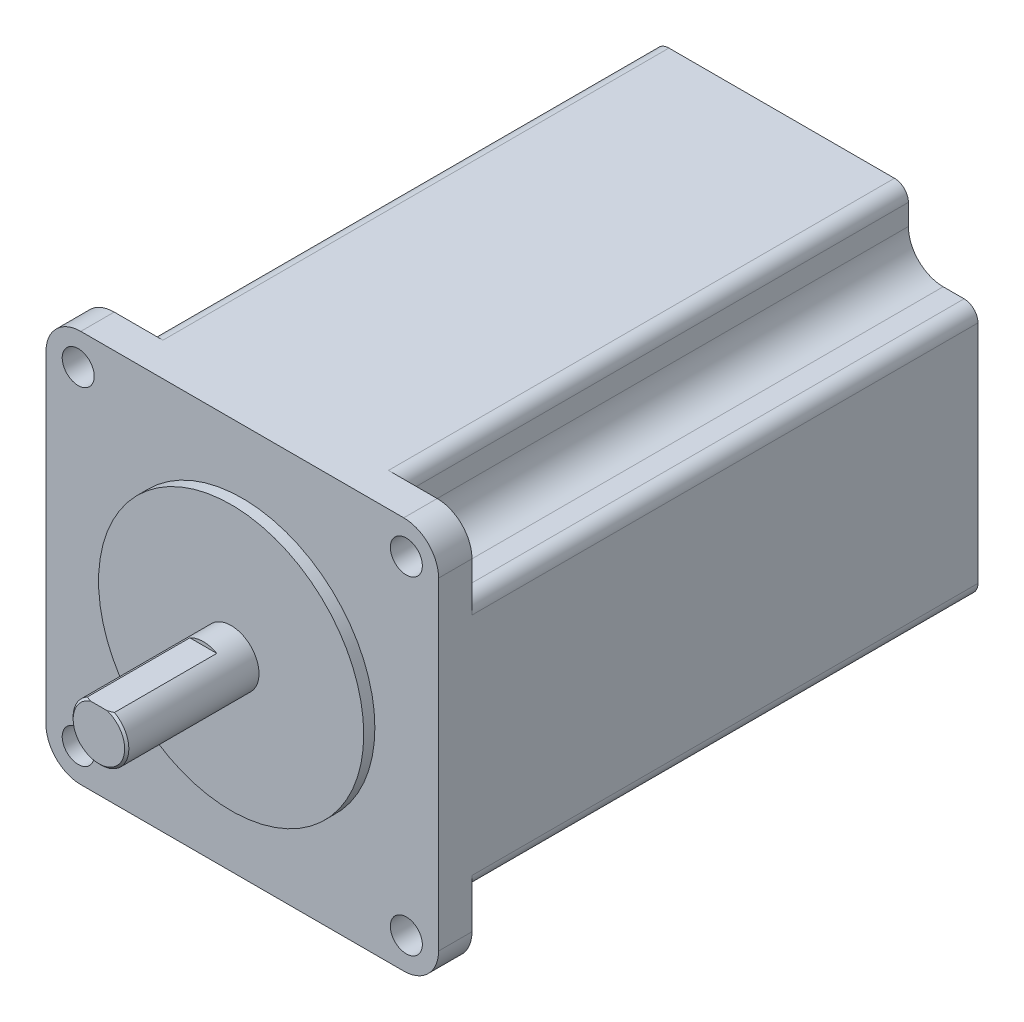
ISO-10303-21;
HEADER;
FILE_DESCRIPTION(('STEP AP214'),'2;1');
FILE_NAME('part.step','',(''),(''),'','','');
FILE_SCHEMA(('AUTOMOTIVE_DESIGN { 1 0 10303 214 1 1 1 1 }'));
ENDSEC;
DATA;
#1=APPLICATION_CONTEXT('core data for automotive mechanical design processes');
#2=APPLICATION_PROTOCOL_DEFINITION('international standard','automotive_design',2000,#1);
#3=PRODUCT_CONTEXT('',#1,'mechanical');
#4=PRODUCT('Part','Part','',(#3));
#5=PRODUCT_RELATED_PRODUCT_CATEGORY('part','',(#4));
#6=PRODUCT_DEFINITION_FORMATION('','',#4);
#7=PRODUCT_DEFINITION_CONTEXT('part definition',#1,'design');
#8=PRODUCT_DEFINITION('design','',#6,#7);
#9=PRODUCT_DEFINITION_SHAPE('','',#8);
#10=(LENGTH_UNIT() NAMED_UNIT(*) SI_UNIT(.MILLI.,.METRE.));
#11=(NAMED_UNIT(*) PLANE_ANGLE_UNIT() SI_UNIT($,.RADIAN.));
#12=(NAMED_UNIT(*) SI_UNIT($,.STERADIAN.) SOLID_ANGLE_UNIT());
#13=UNCERTAINTY_MEASURE_WITH_UNIT(LENGTH_MEASURE(1.E-05),#10,'distance_accuracy_value','');
#14=(GEOMETRIC_REPRESENTATION_CONTEXT(3) GLOBAL_UNCERTAINTY_ASSIGNED_CONTEXT((#13)) GLOBAL_UNIT_ASSIGNED_CONTEXT((#10,
#11,#12)) REPRESENTATION_CONTEXT('',''));
#15=CARTESIAN_POINT('',(0.,0.,0.));
#16=DIRECTION('',(0.,0.,1.));
#17=DIRECTION('',(1.,0.,0.));
#18=AXIS2_PLACEMENT_3D('',#15,#16,#17);
#19=CARTESIAN_POINT('',(23.2,-23.2,-79.1));
#20=DIRECTION('',(0.,0.,1.));
#21=DIRECTION('',(1.,0.,0.));
#22=AXIS2_PLACEMENT_3D('',#19,#20,#21);
#23=CYLINDRICAL_SURFACE('',#22,5.);
#24=CARTESIAN_POINT('',(23.2,-23.2,-6.4));
#25=DIRECTION('',(0.,0.,-1.));
#26=DIRECTION('',(-1.,0.,0.));
#27=AXIS2_PLACEMENT_3D('',#24,#25,#26);
#28=CIRCLE('',#27,5.);
#29=CARTESIAN_POINT('',(28.2,-23.2,-6.4));
#30=VERTEX_POINT('',#29);
#31=CARTESIAN_POINT('',(23.2,-28.2,-6.4));
#32=VERTEX_POINT('',#31);
#33=EDGE_CURVE('E310',#30,#32,#28,.T.);
#34=ORIENTED_EDGE('',*,*,#33,.F.);
#35=DIRECTION('',(0.,0.,1.));
#36=VECTOR('',#35,1.);
#37=CARTESIAN_POINT('',(28.2,-23.2,-79.1));
#38=LINE('',#37,#36);
#39=CARTESIAN_POINT('',(28.2,-23.2,-1.6));
#40=VERTEX_POINT('',#39);
#41=EDGE_CURVE('E475',#30,#40,#38,.T.);
#42=ORIENTED_EDGE('',*,*,#41,.T.);
#43=CARTESIAN_POINT('',(23.2,-23.2,-1.6));
#44=DIRECTION('',(0.,0.,-1.));
#45=DIRECTION('',(1.,0.,0.));
#46=AXIS2_PLACEMENT_3D('',#43,#44,#45);
#47=CIRCLE('',#46,5.);
#48=CARTESIAN_POINT('',(23.2,-28.2,-1.6));
#49=VERTEX_POINT('',#48);
#50=EDGE_CURVE('E465',#40,#49,#47,.T.);
#51=ORIENTED_EDGE('',*,*,#50,.T.);
#52=DIRECTION('',(0.,0.,1.));
#53=VECTOR('',#52,1.);
#54=CARTESIAN_POINT('',(23.2,-28.2,-79.1));
#55=LINE('',#54,#53);
#56=EDGE_CURVE('E511',#32,#49,#55,.T.);
#57=ORIENTED_EDGE('',*,*,#56,.F.);
#58=EDGE_LOOP('',(#34,#42,#51,#57));
#59=FACE_BOUND('',#58,.T.);
#60=ADVANCED_FACE('F35',(#59),#23,.T.);
#61=CARTESIAN_POINT('',(-23.2,-23.2,-79.1));
#62=DIRECTION('',(0.,0.,1.));
#63=DIRECTION('',(1.,0.,0.));
#64=AXIS2_PLACEMENT_3D('',#61,#62,#63);
#65=CYLINDRICAL_SURFACE('',#64,5.);
#66=CARTESIAN_POINT('',(-23.2,-23.2,-6.4));
#67=DIRECTION('',(0.,0.,-1.));
#68=DIRECTION('',(-1.,0.,0.));
#69=AXIS2_PLACEMENT_3D('',#66,#67,#68);
#70=CIRCLE('',#69,5.);
#71=CARTESIAN_POINT('',(-23.2,-28.2,-6.4));
#72=VERTEX_POINT('',#71);
#73=CARTESIAN_POINT('',(-28.2,-23.2,-6.4));
#74=VERTEX_POINT('',#73);
#75=EDGE_CURVE('E355',#72,#74,#70,.T.);
#76=ORIENTED_EDGE('',*,*,#75,.F.);
#77=DIRECTION('',(0.,0.,1.));
#78=VECTOR('',#77,1.);
#79=CARTESIAN_POINT('',(-23.2,-28.2,-79.1));
#80=LINE('',#79,#78);
#81=CARTESIAN_POINT('',(-23.2,-28.2,-1.6));
#82=VERTEX_POINT('',#81);
#83=EDGE_CURVE('E509',#72,#82,#80,.T.);
#84=ORIENTED_EDGE('',*,*,#83,.T.);
#85=CARTESIAN_POINT('',(-23.2,-23.2,-1.6));
#86=DIRECTION('',(0.,0.,-1.));
#87=DIRECTION('',(1.,0.,0.));
#88=AXIS2_PLACEMENT_3D('',#85,#86,#87);
#89=CIRCLE('',#88,5.);
#90=CARTESIAN_POINT('',(-28.2,-23.2,-1.6));
#91=VERTEX_POINT('',#90);
#92=EDGE_CURVE('E481',#82,#91,#89,.T.);
#93=ORIENTED_EDGE('',*,*,#92,.T.);
#94=DIRECTION('',(0.,0.,1.));
#95=VECTOR('',#94,1.);
#96=CARTESIAN_POINT('',(-28.2,-23.2,-79.1));
#97=LINE('',#96,#95);
#98=EDGE_CURVE('E507',#74,#91,#97,.T.);
#99=ORIENTED_EDGE('',*,*,#98,.F.);
#100=EDGE_LOOP('',(#76,#84,#93,#99));
#101=FACE_BOUND('',#100,.T.);
#102=ADVANCED_FACE('F594',(#101),#65,.T.);
#103=CARTESIAN_POINT('',(23.2,23.2,-79.1));
#104=DIRECTION('',(0.,0.,1.));
#105=DIRECTION('',(1.,0.,0.));
#106=AXIS2_PLACEMENT_3D('',#103,#104,#105);
#107=CYLINDRICAL_SURFACE('',#106,5.);
#108=CARTESIAN_POINT('',(23.2,23.2,-6.4));
#109=DIRECTION('',(0.,0.,-1.));
#110=DIRECTION('',(-1.,0.,0.));
#111=AXIS2_PLACEMENT_3D('',#108,#109,#110);
#112=CIRCLE('',#111,5.);
#113=CARTESIAN_POINT('',(23.2,28.2,-6.4));
#114=VERTEX_POINT('',#113);
#115=CARTESIAN_POINT('',(28.2,23.2,-6.4));
#116=VERTEX_POINT('',#115);
#117=EDGE_CURVE('E402',#114,#116,#112,.T.);
#118=ORIENTED_EDGE('',*,*,#117,.F.);
#119=DIRECTION('',(0.,0.,1.));
#120=VECTOR('',#119,1.);
#121=CARTESIAN_POINT('',(23.2,28.2,-79.1));
#122=LINE('',#121,#120);
#123=CARTESIAN_POINT('',(23.2,28.2,-1.6));
#124=VERTEX_POINT('',#123);
#125=EDGE_CURVE('E501',#114,#124,#122,.T.);
#126=ORIENTED_EDGE('',*,*,#125,.T.);
#127=CARTESIAN_POINT('',(23.2,23.2,-1.6));
#128=DIRECTION('',(0.,0.,-1.));
#129=DIRECTION('',(1.,0.,0.));
#130=AXIS2_PLACEMENT_3D('',#127,#128,#129);
#131=CIRCLE('',#130,5.);
#132=CARTESIAN_POINT('',(28.2,23.2,-1.6));
#133=VERTEX_POINT('',#132);
#134=EDGE_CURVE('E493',#124,#133,#131,.T.);
#135=ORIENTED_EDGE('',*,*,#134,.T.);
#136=DIRECTION('',(0.,0.,1.));
#137=VECTOR('',#136,1.);
#138=CARTESIAN_POINT('',(28.2,23.2,-79.1));
#139=LINE('',#138,#137);
#140=EDGE_CURVE('E499',#116,#133,#139,.T.);
#141=ORIENTED_EDGE('',*,*,#140,.F.);
#142=EDGE_LOOP('',(#118,#126,#135,#141));
#143=FACE_BOUND('',#142,.T.);
#144=ADVANCED_FACE('F585',(#143),#107,.T.);
#145=CARTESIAN_POINT('',(0.,0.,0.));
#146=DIRECTION('',(0.,0.,1.));
#147=DIRECTION('',(1.,0.,0.));
#148=AXIS2_PLACEMENT_3D('',#145,#146,#147);
#149=PLANE('',#148);
#150=CARTESIAN_POINT('',(0.,0.,0.));
#151=DIRECTION('',(0.,0.,1.));
#152=DIRECTION('',(1.,0.,0.));
#153=AXIS2_PLACEMENT_3D('',#150,#151,#152);
#154=CIRCLE('',#153,19.05);
#155=CARTESIAN_POINT('',(19.05,0.,0.));
#156=VERTEX_POINT('',#155);
#157=EDGE_CURVE('E530',#156,#156,#154,.T.);
#158=ORIENTED_EDGE('',*,*,#157,.T.);
#159=EDGE_LOOP('',(#158));
#160=FACE_BOUND('',#159,.T.);
#161=CARTESIAN_POINT('',(0.,0.,0.));
#162=DIRECTION('',(0.,0.,1.));
#163=DIRECTION('',(1.,0.,0.));
#164=AXIS2_PLACEMENT_3D('',#161,#162,#163);
#165=CIRCLE('',#164,4.);
#166=CARTESIAN_POINT('',(4.,0.,0.));
#167=VERTEX_POINT('',#166);
#168=EDGE_CURVE('E526',#167,#167,#165,.T.);
#169=ORIENTED_EDGE('',*,*,#168,.F.);
#170=EDGE_LOOP('',(#169));
#171=FACE_BOUND('',#170,.T.);
#172=ADVANCED_FACE('F583',(#160,#171),#149,.T.);
#173=CARTESIAN_POINT('',(0.,0.,-1.6));
#174=DIRECTION('',(0.,0.,1.));
#175=DIRECTION('',(1.,0.,0.));
#176=AXIS2_PLACEMENT_3D('',#173,#174,#175);
#177=CYLINDRICAL_SURFACE('',#176,19.05);
#178=CARTESIAN_POINT('',(0.,0.,-1.6));
#179=DIRECTION('',(0.,0.,1.));
#180=DIRECTION('',(1.,0.,0.));
#181=AXIS2_PLACEMENT_3D('',#178,#179,#180);
#182=CIRCLE('',#181,19.05);
#183=CARTESIAN_POINT('',(19.05,0.,-1.6));
#184=VERTEX_POINT('',#183);
#185=EDGE_CURVE('E513',#184,#184,#182,.F.);
#186=ORIENTED_EDGE('',*,*,#185,.F.);
#187=EDGE_LOOP('',(#186));
#188=FACE_BOUND('',#187,.T.);
#189=ORIENTED_EDGE('',*,*,#157,.F.);
#190=EDGE_LOOP('',(#189));
#191=FACE_BOUND('',#190,.T.);
#192=ADVANCED_FACE('F582',(#188,#191),#177,.T.);
#193=CARTESIAN_POINT('',(0.,0.,19.));
#194=DIRECTION('',(0.,0.,-1.));
#195=DIRECTION('',(-1.,0.,0.));
#196=AXIS2_PLACEMENT_3D('',#193,#194,#195);
#197=CYLINDRICAL_SURFACE('',#196,4.);
#198=DIRECTION('',(0.,0.,1.));
#199=VECTOR('',#198,1.);
#200=CARTESIAN_POINT('',(1.93649167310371,3.5,4.));
#201=LINE('',#200,#199);
#202=CARTESIAN_POINT('',(1.93649167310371,3.5,4.));
#203=VERTEX_POINT('',#202);
#204=CARTESIAN_POINT('',(1.93649167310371,3.5,18.7));
#205=VERTEX_POINT('',#204);
#206=EDGE_CURVE('E524',#203,#205,#201,.T.);
#207=ORIENTED_EDGE('',*,*,#206,.T.);
#208=CARTESIAN_POINT('',(0.,0.,18.7));
#209=DIRECTION('',(0.,0.,1.));
#210=DIRECTION('',(1.,0.,0.));
#211=AXIS2_PLACEMENT_3D('',#208,#209,#210);
#212=CIRCLE('',#211,4.);
#213=CARTESIAN_POINT('',(-1.93649167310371,3.5,18.7));
#214=VERTEX_POINT('',#213);
#215=EDGE_CURVE('E11',#205,#214,#212,.F.);
#216=ORIENTED_EDGE('',*,*,#215,.T.);
#217=DIRECTION('',(0.,0.,1.));
#218=VECTOR('',#217,1.);
#219=CARTESIAN_POINT('',(-1.93649167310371,3.5,4.));
#220=LINE('',#219,#218);
#221=CARTESIAN_POINT('',(-1.93649167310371,3.5,4.));
#222=VERTEX_POINT('',#221);
#223=EDGE_CURVE('E522',#222,#214,#220,.T.);
#224=ORIENTED_EDGE('',*,*,#223,.F.);
#225=CARTESIAN_POINT('',(0.,0.,4.));
#226=DIRECTION('',(0.,0.,1.));
#227=DIRECTION('',(1.,0.,0.));
#228=AXIS2_PLACEMENT_3D('',#225,#226,#227);
#229=CIRCLE('',#228,4.);
#230=EDGE_CURVE('E517',#203,#222,#229,.T.);
#231=ORIENTED_EDGE('',*,*,#230,.F.);
#232=EDGE_LOOP('',(#207,#216,#224,#231));
#233=FACE_BOUND('',#232,.T.);
#234=ORIENTED_EDGE('',*,*,#168,.T.);
#235=EDGE_LOOP('',(#234));
#236=FACE_BOUND('',#235,.T.);
#237=ADVANCED_FACE('F578',(#233,#236),#197,.T.);
#238=CARTESIAN_POINT('',(0.,0.,19.));
#239=DIRECTION('',(0.,0.,1.));
#240=DIRECTION('',(1.,0.,0.));
#241=AXIS2_PLACEMENT_3D('',#238,#239,#240);
#242=PLANE('',#241);
#243=DIRECTION('',(1.,0.,0.));
#244=VECTOR('',#243,1.);
#245=CARTESIAN_POINT('',(-1.93649167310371,3.5,19.));
#246=LINE('',#245,#244);
#247=CARTESIAN_POINT('',(-1.19999999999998,3.5,19.));
#248=VERTEX_POINT('',#247);
#249=CARTESIAN_POINT('',(1.19999999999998,3.5,19.));
#250=VERTEX_POINT('',#249);
#251=EDGE_CURVE('E516',#248,#250,#246,.T.);
#252=ORIENTED_EDGE('',*,*,#251,.F.);
#253=CARTESIAN_POINT('',(0.,0.,19.));
#254=DIRECTION('',(0.,0.,1.));
#255=DIRECTION('',(1.,0.,0.));
#256=AXIS2_PLACEMENT_3D('',#253,#254,#255);
#257=CIRCLE('',#256,3.69999999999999);
#258=EDGE_CURVE('E542',#248,#250,#257,.T.);
#259=ORIENTED_EDGE('',*,*,#258,.T.);
#260=EDGE_LOOP('',(#252,#259));
#261=FACE_BOUND('',#260,.T.);
#262=ADVANCED_FACE('F573',(#261),#242,.T.);
#263=CARTESIAN_POINT('',(-1.93649167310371,3.5,4.));
#264=DIRECTION('',(0.,-1.,0.));
#265=DIRECTION('',(0.,0.,-1.));
#266=AXIS2_PLACEMENT_3D('',#263,#264,#265);
#267=PLANE('',#266);
#268=ORIENTED_EDGE('',*,*,#251,.T.);
#269=CARTESIAN_POINT('',(1.19999999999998,3.5,19.));
#270=CARTESIAN_POINT('',(1.26313496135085,3.5,18.979522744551));
#271=CARTESIAN_POINT('',(1.32583684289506,3.5,18.9577420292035));
#272=CARTESIAN_POINT('',(1.45030237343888,3.5,18.9118563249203));
#273=CARTESIAN_POINT('',(1.51206703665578,3.5,18.8877540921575));
#274=CARTESIAN_POINT('',(1.63472492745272,3.5,18.8374625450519));
#275=CARTESIAN_POINT('',(1.69561828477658,3.5,18.8112735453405));
#276=CARTESIAN_POINT('',(1.8166407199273,3.5,18.7569984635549));
#277=CARTESIAN_POINT('',(1.87676881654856,3.5,18.7289101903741));
#278=CARTESIAN_POINT('',(1.93649167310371,3.5,18.7));
#279=B_SPLINE_CURVE_WITH_KNOTS('',3,(#269,#270,#271,#272,#273,#274,#275,#276,#277,#278),
.UNSPECIFIED.,.F.,.F.,(4,2,2,2,4),(0.,0.199089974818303,0.397946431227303,0.596772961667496,
0.795832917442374),.UNSPECIFIED.);
#280=EDGE_CURVE('E44',#250,#205,#279,.T.);
#281=ORIENTED_EDGE('',*,*,#280,.T.);
#282=ORIENTED_EDGE('',*,*,#206,.F.);
#283=DIRECTION('',(1.,0.,0.));
#284=VECTOR('',#283,1.);
#285=CARTESIAN_POINT('',(-1.93649167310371,3.5,4.));
#286=LINE('',#285,#284);
#287=EDGE_CURVE('E519',#222,#203,#286,.T.);
#288=ORIENTED_EDGE('',*,*,#287,.F.);
#289=ORIENTED_EDGE('',*,*,#223,.T.);
#290=CARTESIAN_POINT('',(-1.93649167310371,3.5,18.7));
#291=CARTESIAN_POINT('',(-1.87676881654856,3.5,18.7289101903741));
#292=CARTESIAN_POINT('',(-1.8166407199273,3.5,18.7569984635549));
#293=CARTESIAN_POINT('',(-1.69561828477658,3.5,18.8112735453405));
#294=CARTESIAN_POINT('',(-1.63472492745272,3.5,18.8374625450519));
#295=CARTESIAN_POINT('',(-1.51206703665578,3.5,18.8877540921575));
#296=CARTESIAN_POINT('',(-1.45030237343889,3.5,18.9118563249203));
#297=CARTESIAN_POINT('',(-1.32583684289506,3.5,18.9577420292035));
#298=CARTESIAN_POINT('',(-1.26313496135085,3.5,18.979522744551));
#299=CARTESIAN_POINT('',(-1.19999999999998,3.5,19.));
#300=B_SPLINE_CURVE_WITH_KNOTS('',3,(#290,#291,#292,#293,#294,#295,#296,#297,#298,#299),
.UNSPECIFIED.,.F.,.F.,(4,2,2,2,4),(0.,0.199059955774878,0.397886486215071,0.596742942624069,
0.795832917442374),.UNSPECIFIED.);
#301=EDGE_CURVE('E559',#214,#248,#300,.T.);
#302=ORIENTED_EDGE('',*,*,#301,.T.);
#303=EDGE_LOOP('',(#268,#281,#282,#288,#289,#302));
#304=FACE_BOUND('',#303,.T.);
#305=ADVANCED_FACE('F567',(#304),#267,.F.);
#306=CARTESIAN_POINT('',(0.,0.,4.));
#307=DIRECTION('',(0.,0.,1.));
#308=DIRECTION('',(1.,0.,0.));
#309=AXIS2_PLACEMENT_3D('',#306,#307,#308);
#310=PLANE('',#309);
#311=ORIENTED_EDGE('',*,*,#230,.T.);
#312=ORIENTED_EDGE('',*,*,#287,.T.);
#313=EDGE_LOOP('',(#311,#312));
#314=FACE_BOUND('',#313,.T.);
#315=ADVANCED_FACE('F572',(#314),#310,.T.);
#316=CARTESIAN_POINT('',(-23.2,-28.2,-79.1));
#317=DIRECTION('',(0.,1.,0.));
#318=DIRECTION('',(-1.,0.,0.));
#319=AXIS2_PLACEMENT_3D('',#316,#317,#318);
#320=PLANE('',#319);
#321=DIRECTION('',(0.,0.,-1.));
#322=VECTOR('',#321,1.);
#323=CARTESIAN_POINT('',(-16.2,-28.2,-6.4));
#324=LINE('',#323,#322);
#325=CARTESIAN_POINT('',(-16.2,-28.2,-6.4));
#326=VERTEX_POINT('',#325);
#327=CARTESIAN_POINT('',(-16.2,-28.2,-79.1));
#328=VERTEX_POINT('',#327);
#329=EDGE_CURVE('E339',#326,#328,#324,.T.);
#330=ORIENTED_EDGE('',*,*,#329,.T.);
#331=DIRECTION('',(-1.,0.,0.));
#332=VECTOR('',#331,1.);
#333=CARTESIAN_POINT('',(-23.2,-28.2,-79.1));
#334=LINE('',#333,#332);
#335=CARTESIAN_POINT('',(16.2,-28.2,-79.1));
#336=VERTEX_POINT('',#335);
#337=EDGE_CURVE('E466',#336,#328,#334,.T.);
#338=ORIENTED_EDGE('',*,*,#337,.F.);
#339=DIRECTION('',(0.,0.,-1.));
#340=VECTOR('',#339,1.);
#341=CARTESIAN_POINT('',(16.2,-28.2,-6.4));
#342=LINE('',#341,#340);
#343=CARTESIAN_POINT('',(16.2,-28.2,-6.4));
#344=VERTEX_POINT('',#343);
#345=EDGE_CURVE('E313',#344,#336,#342,.T.);
#346=ORIENTED_EDGE('',*,*,#345,.F.);
#347=DIRECTION('',(-1.,0.,0.));
#348=VECTOR('',#347,1.);
#349=CARTESIAN_POINT('',(-23.2,-28.2,-6.4));
#350=LINE('',#349,#348);
#351=EDGE_CURVE('E320',#32,#344,#350,.T.);
#352=ORIENTED_EDGE('',*,*,#351,.F.);
#353=ORIENTED_EDGE('',*,*,#56,.T.);
#354=DIRECTION('',(-1.,0.,0.));
#355=VECTOR('',#354,1.);
#356=CARTESIAN_POINT('',(-23.2,-28.2,-1.6));
#357=LINE('',#356,#355);
#358=EDGE_CURVE('E478',#49,#82,#357,.T.);
#359=ORIENTED_EDGE('',*,*,#358,.T.);
#360=ORIENTED_EDGE('',*,*,#83,.F.);
#361=DIRECTION('',(-1.,0.,0.));
#362=VECTOR('',#361,1.);
#363=CARTESIAN_POINT('',(-23.2,-28.2,-6.4));
#364=LINE('',#363,#362);
#365=EDGE_CURVE('E367',#326,#72,#364,.T.);
#366=ORIENTED_EDGE('',*,*,#365,.F.);
#367=EDGE_LOOP('',(#330,#338,#346,#352,#353,#359,#360,#366));
#368=FACE_BOUND('',#367,.T.);
#369=ADVANCED_FACE('F603',(#368),#320,.F.);
#370=CARTESIAN_POINT('',(-28.2,23.2,-79.1));
#371=DIRECTION('',(1.,0.,0.));
#372=DIRECTION('',(0.,1.,0.));
#373=AXIS2_PLACEMENT_3D('',#370,#371,#372);
#374=PLANE('',#373);
#375=DIRECTION('',(0.,0.,-1.));
#376=VECTOR('',#375,1.);
#377=CARTESIAN_POINT('',(-28.2,16.2,-6.4));
#378=LINE('',#377,#376);
#379=CARTESIAN_POINT('',(-28.2,16.2,-6.4));
#380=VERTEX_POINT('',#379);
#381=CARTESIAN_POINT('',(-28.2,16.2,-79.1));
#382=VERTEX_POINT('',#381);
#383=EDGE_CURVE('E447',#380,#382,#378,.T.);
#384=ORIENTED_EDGE('',*,*,#383,.T.);
#385=DIRECTION('',(0.,1.,0.));
#386=VECTOR('',#385,1.);
#387=CARTESIAN_POINT('',(-28.2,23.2,-79.1));
#388=LINE('',#387,#386);
#389=CARTESIAN_POINT('',(-28.2,-16.2,-79.1));
#390=VERTEX_POINT('',#389);
#391=EDGE_CURVE('E468',#390,#382,#388,.T.);
#392=ORIENTED_EDGE('',*,*,#391,.F.);
#393=DIRECTION('',(0.,0.,-1.));
#394=VECTOR('',#393,1.);
#395=CARTESIAN_POINT('',(-28.2,-16.2,-6.4));
#396=LINE('',#395,#394);
#397=CARTESIAN_POINT('',(-28.2,-16.2,-6.4));
#398=VERTEX_POINT('',#397);
#399=EDGE_CURVE('E362',#398,#390,#396,.T.);
#400=ORIENTED_EDGE('',*,*,#399,.F.);
#401=DIRECTION('',(0.,1.,0.));
#402=VECTOR('',#401,1.);
#403=CARTESIAN_POINT('',(-28.2,23.2,-6.4));
#404=LINE('',#403,#402);
#405=EDGE_CURVE('E538',#74,#398,#404,.T.);
#406=ORIENTED_EDGE('',*,*,#405,.F.);
#407=ORIENTED_EDGE('',*,*,#98,.T.);
#408=DIRECTION('',(0.,1.,0.));
#409=VECTOR('',#408,1.);
#410=CARTESIAN_POINT('',(-28.2,23.2,-1.6));
#411=LINE('',#410,#409);
#412=CARTESIAN_POINT('',(-28.2,23.2,-1.6));
#413=VERTEX_POINT('',#412);
#414=EDGE_CURVE('E484',#91,#413,#411,.T.);
#415=ORIENTED_EDGE('',*,*,#414,.T.);
#416=DIRECTION('',(0.,0.,1.));
#417=VECTOR('',#416,1.);
#418=CARTESIAN_POINT('',(-28.2,23.2,-79.1));
#419=LINE('',#418,#417);
#420=CARTESIAN_POINT('',(-28.2,23.2,-6.4));
#421=VERTEX_POINT('',#420);
#422=EDGE_CURVE('E505',#421,#413,#419,.T.);
#423=ORIENTED_EDGE('',*,*,#422,.F.);
#424=DIRECTION('',(0.,-1.,0.));
#425=VECTOR('',#424,1.);
#426=CARTESIAN_POINT('',(-28.2,23.2,-6.4));
#427=LINE('',#426,#425);
#428=EDGE_CURVE('E462',#421,#380,#427,.T.);
#429=ORIENTED_EDGE('',*,*,#428,.T.);
#430=EDGE_LOOP('',(#384,#392,#400,#406,#407,#415,#423,#429));
#431=FACE_BOUND('',#430,.T.);
#432=ADVANCED_FACE('F605',(#431),#374,.F.);
#433=CARTESIAN_POINT('',(-23.2,23.2,-79.1));
#434=DIRECTION('',(0.,0.,1.));
#435=DIRECTION('',(1.,0.,0.));
#436=AXIS2_PLACEMENT_3D('',#433,#434,#435);
#437=CYLINDRICAL_SURFACE('',#436,5.);
#438=DIRECTION('',(0.,0.,1.));
#439=VECTOR('',#438,1.);
#440=CARTESIAN_POINT('',(-23.2,28.2,-79.1));
#441=LINE('',#440,#439);
#442=CARTESIAN_POINT('',(-23.2,28.2,-6.4));
#443=VERTEX_POINT('',#442);
#444=CARTESIAN_POINT('',(-23.2,28.2,-1.6));
#445=VERTEX_POINT('',#444);
#446=EDGE_CURVE('E503',#443,#445,#441,.T.);
#447=ORIENTED_EDGE('',*,*,#446,.F.);
#448=CARTESIAN_POINT('',(-23.2,23.2,-6.4));
#449=DIRECTION('',(0.,0.,1.));
#450=DIRECTION('',(1.,0.,0.));
#451=AXIS2_PLACEMENT_3D('',#448,#449,#450);
#452=CIRCLE('',#451,5.);
#453=EDGE_CURVE('E450',#443,#421,#452,.T.);
#454=ORIENTED_EDGE('',*,*,#453,.T.);
#455=ORIENTED_EDGE('',*,*,#422,.T.);
#456=CARTESIAN_POINT('',(-23.2,23.2,-1.6));
#457=DIRECTION('',(0.,0.,-1.));
#458=DIRECTION('',(1.,0.,0.));
#459=AXIS2_PLACEMENT_3D('',#456,#457,#458);
#460=CIRCLE('',#459,5.);
#461=EDGE_CURVE('E487',#413,#445,#460,.T.);
#462=ORIENTED_EDGE('',*,*,#461,.T.);
#463=EDGE_LOOP('',(#447,#454,#455,#462));
#464=FACE_BOUND('',#463,.T.);
#465=ADVANCED_FACE('F610',(#464),#437,.T.);
#466=CARTESIAN_POINT('',(23.2,28.2,-79.1));
#467=DIRECTION('',(0.,-1.,0.));
#468=DIRECTION('',(1.,0.,0.));
#469=AXIS2_PLACEMENT_3D('',#466,#467,#468);
#470=PLANE('',#469);
#471=DIRECTION('',(0.,0.,-1.));
#472=VECTOR('',#471,1.);
#473=CARTESIAN_POINT('',(16.2,28.2,-6.4));
#474=LINE('',#473,#472);
#475=CARTESIAN_POINT('',(16.2,28.2,-6.4));
#476=VERTEX_POINT('',#475);
#477=CARTESIAN_POINT('',(16.2,28.2,-79.1));
#478=VERTEX_POINT('',#477);
#479=EDGE_CURVE('E386',#476,#478,#474,.T.);
#480=ORIENTED_EDGE('',*,*,#479,.T.);
#481=DIRECTION('',(1.,0.,0.));
#482=VECTOR('',#481,1.);
#483=CARTESIAN_POINT('',(0.,28.2,-79.1));
#484=LINE('',#483,#482);
#485=CARTESIAN_POINT('',(-16.2,28.2,-79.1));
#486=VERTEX_POINT('',#485);
#487=EDGE_CURVE('E471',#486,#478,#484,.T.);
#488=ORIENTED_EDGE('',*,*,#487,.F.);
#489=DIRECTION('',(0.,0.,-1.));
#490=VECTOR('',#489,1.);
#491=CARTESIAN_POINT('',(-16.2,28.2,-6.4));
#492=LINE('',#491,#490);
#493=CARTESIAN_POINT('',(-16.2,28.2,-6.4));
#494=VERTEX_POINT('',#493);
#495=EDGE_CURVE('E433',#494,#486,#492,.T.);
#496=ORIENTED_EDGE('',*,*,#495,.F.);
#497=DIRECTION('',(-1.,0.,0.));
#498=VECTOR('',#497,1.);
#499=CARTESIAN_POINT('',(23.2,28.2,-6.4));
#500=LINE('',#499,#498);
#501=EDGE_CURVE('E533',#494,#443,#500,.T.);
#502=ORIENTED_EDGE('',*,*,#501,.T.);
#503=ORIENTED_EDGE('',*,*,#446,.T.);
#504=DIRECTION('',(1.,0.,0.));
#505=VECTOR('',#504,1.);
#506=CARTESIAN_POINT('',(23.2,28.2,-1.6));
#507=LINE('',#506,#505);
#508=EDGE_CURVE('E490',#445,#124,#507,.T.);
#509=ORIENTED_EDGE('',*,*,#508,.T.);
#510=ORIENTED_EDGE('',*,*,#125,.F.);
#511=DIRECTION('',(1.,0.,0.));
#512=VECTOR('',#511,1.);
#513=CARTESIAN_POINT('',(23.2,28.2,-6.4));
#514=LINE('',#513,#512);
#515=EDGE_CURVE('E414',#476,#114,#514,.T.);
#516=ORIENTED_EDGE('',*,*,#515,.F.);
#517=EDGE_LOOP('',(#480,#488,#496,#502,#503,#509,#510,#516));
#518=FACE_BOUND('',#517,.T.);
#519=ADVANCED_FACE('F614',(#518),#470,.F.);
#520=CARTESIAN_POINT('',(28.2,-23.2,-79.1));
#521=DIRECTION('',(-1.,0.,0.));
#522=DIRECTION('',(0.,0.,1.));
#523=AXIS2_PLACEMENT_3D('',#520,#521,#522);
#524=PLANE('',#523);
#525=DIRECTION('',(0.,0.,-1.));
#526=VECTOR('',#525,1.);
#527=CARTESIAN_POINT('',(28.2,-16.2,-6.4));
#528=LINE('',#527,#526);
#529=CARTESIAN_POINT('',(28.2,-16.2,-6.4));
#530=VERTEX_POINT('',#529);
#531=CARTESIAN_POINT('',(28.2,-16.2,-79.1));
#532=VERTEX_POINT('',#531);
#533=EDGE_CURVE('E315',#530,#532,#528,.T.);
#534=ORIENTED_EDGE('',*,*,#533,.T.);
#535=DIRECTION('',(0.,-1.,0.));
#536=VECTOR('',#535,1.);
#537=CARTESIAN_POINT('',(28.2,-23.2,-79.1));
#538=LINE('',#537,#536);
#539=CARTESIAN_POINT('',(28.2,16.2,-79.1));
#540=VERTEX_POINT('',#539);
#541=EDGE_CURVE('E473',#540,#532,#538,.T.);
#542=ORIENTED_EDGE('',*,*,#541,.F.);
#543=DIRECTION('',(0.,0.,-1.));
#544=VECTOR('',#543,1.);
#545=CARTESIAN_POINT('',(28.2,16.2,-6.4));
#546=LINE('',#545,#544);
#547=CARTESIAN_POINT('',(28.2,16.2,-6.4));
#548=VERTEX_POINT('',#547);
#549=EDGE_CURVE('E409',#548,#540,#546,.T.);
#550=ORIENTED_EDGE('',*,*,#549,.F.);
#551=DIRECTION('',(0.,-1.,0.));
#552=VECTOR('',#551,1.);
#553=CARTESIAN_POINT('',(28.2,-23.2,-6.4));
#554=LINE('',#553,#552);
#555=EDGE_CURVE('E536',#116,#548,#554,.T.);
#556=ORIENTED_EDGE('',*,*,#555,.F.);
#557=ORIENTED_EDGE('',*,*,#140,.T.);
#558=DIRECTION('',(0.,-1.,0.));
#559=VECTOR('',#558,1.);
#560=CARTESIAN_POINT('',(28.2,-23.2,-1.6));
#561=LINE('',#560,#559);
#562=EDGE_CURVE('E469',#133,#40,#561,.T.);
#563=ORIENTED_EDGE('',*,*,#562,.T.);
#564=ORIENTED_EDGE('',*,*,#41,.F.);
#565=DIRECTION('',(0.,-1.,0.));
#566=VECTOR('',#565,1.);
#567=CARTESIAN_POINT('',(28.2,-23.2,-6.4));
#568=LINE('',#567,#566);
#569=EDGE_CURVE('E540',#530,#30,#568,.T.);
#570=ORIENTED_EDGE('',*,*,#569,.F.);
#571=EDGE_LOOP('',(#534,#542,#550,#556,#557,#563,#564,#570));
#572=FACE_BOUND('',#571,.T.);
#573=ADVANCED_FACE('F618',(#572),#524,.F.);
#574=CARTESIAN_POINT('',(23.2,-23.2,-79.1));
#575=DIRECTION('',(0.,0.,1.));
#576=DIRECTION('',(1.,0.,0.));
#577=AXIS2_PLACEMENT_3D('',#574,#575,#576);
#578=PLANE('',#577);
#579=DIRECTION('',(0.,1.,0.));
#580=VECTOR('',#579,1.);
#581=CARTESIAN_POINT('',(18.2,-26.2,-79.1));
#582=LINE('',#581,#580);
#583=CARTESIAN_POINT('',(18.2,-26.2,-79.1));
#584=VERTEX_POINT('',#583);
#585=CARTESIAN_POINT('',(18.2,-23.2,-79.1));
#586=VERTEX_POINT('',#585);
#587=EDGE_CURVE('E286',#584,#586,#582,.T.);
#588=ORIENTED_EDGE('',*,*,#587,.F.);
#589=CARTESIAN_POINT('',(16.2,-26.2,-79.1));
#590=DIRECTION('',(0.,0.,1.));
#591=DIRECTION('',(1.,0.,0.));
#592=AXIS2_PLACEMENT_3D('',#589,#590,#591);
#593=CIRCLE('',#592,1.99999999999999);
#594=EDGE_CURVE('E289',#336,#584,#593,.T.);
#595=ORIENTED_EDGE('',*,*,#594,.F.);
#596=ORIENTED_EDGE('',*,*,#337,.T.);
#597=CARTESIAN_POINT('',(-16.2,-26.2,-79.1));
#598=DIRECTION('',(0.,0.,1.));
#599=DIRECTION('',(-1.,0.,0.));
#600=AXIS2_PLACEMENT_3D('',#597,#598,#599);
#601=CIRCLE('',#600,2.);
#602=CARTESIAN_POINT('',(-18.2,-26.2,-79.1));
#603=VERTEX_POINT('',#602);
#604=EDGE_CURVE('E322',#603,#328,#601,.T.);
#605=ORIENTED_EDGE('',*,*,#604,.F.);
#606=DIRECTION('',(0.,-1.,0.));
#607=VECTOR('',#606,1.);
#608=CARTESIAN_POINT('',(-18.2,-26.2,-79.1));
#609=LINE('',#608,#607);
#610=CARTESIAN_POINT('',(-18.2,-23.2,-79.1));
#611=VERTEX_POINT('',#610);
#612=EDGE_CURVE('E327',#611,#603,#609,.T.);
#613=ORIENTED_EDGE('',*,*,#612,.F.);
#614=CARTESIAN_POINT('',(-23.2,-23.2,-79.1));
#615=DIRECTION('',(0.,0.,-1.));
#616=DIRECTION('',(1.,0.,0.));
#617=AXIS2_PLACEMENT_3D('',#614,#615,#616);
#618=CIRCLE('',#617,5.);
#619=CARTESIAN_POINT('',(-23.2,-18.2,-79.1));
#620=VERTEX_POINT('',#619);
#621=EDGE_CURVE('E348',#620,#611,#618,.T.);
#622=ORIENTED_EDGE('',*,*,#621,.F.);
#623=DIRECTION('',(1.,0.,0.));
#624=VECTOR('',#623,1.);
#625=CARTESIAN_POINT('',(-23.2,-18.2,-79.1));
#626=LINE('',#625,#624);
#627=CARTESIAN_POINT('',(-26.2,-18.2,-79.1));
#628=VERTEX_POINT('',#627);
#629=EDGE_CURVE('E345',#628,#620,#626,.T.);
#630=ORIENTED_EDGE('',*,*,#629,.F.);
#631=CARTESIAN_POINT('',(-26.2,-16.2,-79.1));
#632=DIRECTION('',(0.,0.,1.));
#633=DIRECTION('',(-1.,0.,0.));
#634=AXIS2_PLACEMENT_3D('',#631,#632,#633);
#635=CIRCLE('',#634,2.);
#636=EDGE_CURVE('E342',#390,#628,#635,.T.);
#637=ORIENTED_EDGE('',*,*,#636,.F.);
#638=ORIENTED_EDGE('',*,*,#391,.T.);
#639=CARTESIAN_POINT('',(-26.2,16.2,-79.1));
#640=DIRECTION('',(0.,0.,1.));
#641=DIRECTION('',(1.,0.,0.));
#642=AXIS2_PLACEMENT_3D('',#639,#640,#641);
#643=CIRCLE('',#642,2.);
#644=CARTESIAN_POINT('',(-26.2,18.2,-79.1));
#645=VERTEX_POINT('',#644);
#646=EDGE_CURVE('E421',#645,#382,#643,.T.);
#647=ORIENTED_EDGE('',*,*,#646,.F.);
#648=DIRECTION('',(-1.,0.,0.));
#649=VECTOR('',#648,1.);
#650=CARTESIAN_POINT('',(-23.2,18.2,-79.1));
#651=LINE('',#650,#649);
#652=CARTESIAN_POINT('',(-23.2,18.2,-79.1));
#653=VERTEX_POINT('',#652);
#654=EDGE_CURVE('E442',#653,#645,#651,.T.);
#655=ORIENTED_EDGE('',*,*,#654,.F.);
#656=CARTESIAN_POINT('',(-23.2,23.2,-79.1));
#657=DIRECTION('',(0.,0.,-1.));
#658=DIRECTION('',(-1.,0.,0.));
#659=AXIS2_PLACEMENT_3D('',#656,#657,#658);
#660=CIRCLE('',#659,5.);
#661=CARTESIAN_POINT('',(-18.2,23.2,-79.1));
#662=VERTEX_POINT('',#661);
#663=EDGE_CURVE('E439',#662,#653,#660,.T.);
#664=ORIENTED_EDGE('',*,*,#663,.F.);
#665=DIRECTION('',(0.,-1.,0.));
#666=VECTOR('',#665,1.);
#667=CARTESIAN_POINT('',(-18.2,26.2,-79.1));
#668=LINE('',#667,#666);
#669=CARTESIAN_POINT('',(-18.2,26.2,-79.1));
#670=VERTEX_POINT('',#669);
#671=EDGE_CURVE('E436',#670,#662,#668,.T.);
#672=ORIENTED_EDGE('',*,*,#671,.F.);
#673=CARTESIAN_POINT('',(-16.2,26.2,-79.1));
#674=DIRECTION('',(0.,0.,1.));
#675=DIRECTION('',(1.,0.,0.));
#676=AXIS2_PLACEMENT_3D('',#673,#674,#675);
#677=CIRCLE('',#676,2.);
#678=EDGE_CURVE('E416',#486,#670,#677,.T.);
#679=ORIENTED_EDGE('',*,*,#678,.F.);
#680=ORIENTED_EDGE('',*,*,#487,.T.);
#681=CARTESIAN_POINT('',(16.2,26.2,-79.1));
#682=DIRECTION('',(0.,0.,1.));
#683=DIRECTION('',(-1.,0.,0.));
#684=AXIS2_PLACEMENT_3D('',#681,#682,#683);
#685=CIRCLE('',#684,1.99999999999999);
#686=CARTESIAN_POINT('',(18.2,26.2,-79.1));
#687=VERTEX_POINT('',#686);
#688=EDGE_CURVE('E369',#687,#478,#685,.T.);
#689=ORIENTED_EDGE('',*,*,#688,.F.);
#690=DIRECTION('',(0.,1.,0.));
#691=VECTOR('',#690,1.);
#692=CARTESIAN_POINT('',(18.2,26.2,-79.1));
#693=LINE('',#692,#691);
#694=CARTESIAN_POINT('',(18.2,23.2,-79.1));
#695=VERTEX_POINT('',#694);
#696=EDGE_CURVE('E374',#695,#687,#693,.T.);
#697=ORIENTED_EDGE('',*,*,#696,.F.);
#698=CARTESIAN_POINT('',(23.2,23.2,-79.1));
#699=DIRECTION('',(0.,0.,-1.));
#700=DIRECTION('',(1.,0.,0.));
#701=AXIS2_PLACEMENT_3D('',#698,#699,#700);
#702=CIRCLE('',#701,5.);
#703=CARTESIAN_POINT('',(23.2,18.2,-79.1));
#704=VERTEX_POINT('',#703);
#705=EDGE_CURVE('E395',#704,#695,#702,.T.);
#706=ORIENTED_EDGE('',*,*,#705,.F.);
#707=DIRECTION('',(-1.,0.,0.));
#708=VECTOR('',#707,1.);
#709=CARTESIAN_POINT('',(23.2,18.2,-79.1));
#710=LINE('',#709,#708);
#711=CARTESIAN_POINT('',(26.2,18.2,-79.1));
#712=VERTEX_POINT('',#711);
#713=EDGE_CURVE('E392',#712,#704,#710,.T.);
#714=ORIENTED_EDGE('',*,*,#713,.F.);
#715=CARTESIAN_POINT('',(26.2,16.2,-79.1));
#716=DIRECTION('',(0.,0.,1.));
#717=DIRECTION('',(-1.,0.,0.));
#718=AXIS2_PLACEMENT_3D('',#715,#716,#717);
#719=CIRCLE('',#718,2.);
#720=EDGE_CURVE('E389',#540,#712,#719,.T.);
#721=ORIENTED_EDGE('',*,*,#720,.F.);
#722=ORIENTED_EDGE('',*,*,#541,.T.);
#723=CARTESIAN_POINT('',(26.2,-16.2,-79.1));
#724=DIRECTION('',(0.,0.,1.));
#725=DIRECTION('',(1.,0.,0.));
#726=AXIS2_PLACEMENT_3D('',#723,#724,#725);
#727=CIRCLE('',#726,2.);
#728=CARTESIAN_POINT('',(26.2,-18.2,-79.1));
#729=VERTEX_POINT('',#728);
#730=EDGE_CURVE('E303',#729,#532,#727,.T.);
#731=ORIENTED_EDGE('',*,*,#730,.F.);
#732=DIRECTION('',(1.,0.,0.));
#733=VECTOR('',#732,1.);
#734=CARTESIAN_POINT('',(23.2,-18.2,-79.1));
#735=LINE('',#734,#733);
#736=CARTESIAN_POINT('',(23.2,-18.2,-79.1));
#737=VERTEX_POINT('',#736);
#738=EDGE_CURVE('E300',#737,#729,#735,.T.);
#739=ORIENTED_EDGE('',*,*,#738,.F.);
#740=CARTESIAN_POINT('',(23.2,-23.2,-79.1));
#741=DIRECTION('',(0.,0.,-1.));
#742=DIRECTION('',(-1.,0.,0.));
#743=AXIS2_PLACEMENT_3D('',#740,#741,#742);
#744=CIRCLE('',#743,5.);
#745=EDGE_CURVE('E268',#586,#737,#744,.T.);
#746=ORIENTED_EDGE('',*,*,#745,.F.);
#747=EDGE_LOOP('',(#588,#595,#596,#605,#613,#622,#630,#637,#638,#647,#655,#664,#672,#679,#680,
#689,#697,#706,#714,#721,#722,#731,#739,#746));
#748=FACE_BOUND('',#747,.T.);
#749=ADVANCED_FACE('F625',(#748),#578,.F.);
#750=CARTESIAN_POINT('',(23.2,-23.2,-1.6));
#751=DIRECTION('',(0.,0.,1.));
#752=DIRECTION('',(1.,0.,0.));
#753=AXIS2_PLACEMENT_3D('',#750,#751,#752);
#754=PLANE('',#753);
#755=CARTESIAN_POINT('',(-23.57,-23.57,-1.6));
#756=DIRECTION('',(0.,0.,1.));
#757=DIRECTION('',(1.,0.,0.));
#758=AXIS2_PLACEMENT_3D('',#755,#756,#757);
#759=CIRCLE('',#758,2.3);
#760=CARTESIAN_POINT('',(-21.27,-23.57,-1.6));
#761=VERTEX_POINT('',#760);
#762=EDGE_CURVE('E556',#761,#761,#759,.T.);
#763=ORIENTED_EDGE('',*,*,#762,.F.);
#764=EDGE_LOOP('',(#763));
#765=FACE_BOUND('',#764,.T.);
#766=CARTESIAN_POINT('',(23.57,-23.57,-1.6));
#767=DIRECTION('',(0.,0.,1.));
#768=DIRECTION('',(1.,0.,0.));
#769=AXIS2_PLACEMENT_3D('',#766,#767,#768);
#770=CIRCLE('',#769,2.3);
#771=CARTESIAN_POINT('',(25.87,-23.57,-1.6));
#772=VERTEX_POINT('',#771);
#773=EDGE_CURVE('E552',#772,#772,#770,.T.);
#774=ORIENTED_EDGE('',*,*,#773,.F.);
#775=EDGE_LOOP('',(#774));
#776=FACE_BOUND('',#775,.T.);
#777=CARTESIAN_POINT('',(23.57,23.57,-1.6));
#778=DIRECTION('',(0.,0.,1.));
#779=DIRECTION('',(1.,0.,0.));
#780=AXIS2_PLACEMENT_3D('',#777,#778,#779);
#781=CIRCLE('',#780,2.3);
#782=CARTESIAN_POINT('',(25.87,23.57,-1.6));
#783=VERTEX_POINT('',#782);
#784=EDGE_CURVE('E548',#783,#783,#781,.T.);
#785=ORIENTED_EDGE('',*,*,#784,.F.);
#786=EDGE_LOOP('',(#785));
#787=FACE_BOUND('',#786,.T.);
#788=CARTESIAN_POINT('',(-23.57,23.57,-1.6));
#789=DIRECTION('',(0.,0.,1.));
#790=DIRECTION('',(1.,0.,0.));
#791=AXIS2_PLACEMENT_3D('',#788,#789,#790);
#792=CIRCLE('',#791,2.3);
#793=CARTESIAN_POINT('',(-21.27,23.57,-1.6));
#794=VERTEX_POINT('',#793);
#795=EDGE_CURVE('E292',#794,#794,#792,.T.);
#796=ORIENTED_EDGE('',*,*,#795,.F.);
#797=EDGE_LOOP('',(#796));
#798=FACE_BOUND('',#797,.T.);
#799=ORIENTED_EDGE('',*,*,#185,.T.);
#800=EDGE_LOOP('',(#799));
#801=FACE_BOUND('',#800,.T.);
#802=ORIENTED_EDGE('',*,*,#50,.F.);
#803=ORIENTED_EDGE('',*,*,#562,.F.);
#804=ORIENTED_EDGE('',*,*,#134,.F.);
#805=ORIENTED_EDGE('',*,*,#508,.F.);
#806=ORIENTED_EDGE('',*,*,#461,.F.);
#807=ORIENTED_EDGE('',*,*,#414,.F.);
#808=ORIENTED_EDGE('',*,*,#92,.F.);
#809=ORIENTED_EDGE('',*,*,#358,.F.);
#810=EDGE_LOOP('',(#802,#803,#804,#805,#806,#807,#808,#809));
#811=FACE_BOUND('',#810,.T.);
#812=ADVANCED_FACE('F627',(#765,#776,#787,#798,#801,#811),#754,.T.);
#813=CARTESIAN_POINT('',(-16.2,26.2,-6.4));
#814=DIRECTION('',(0.,0.,1.));
#815=DIRECTION('',(1.,0.,0.));
#816=AXIS2_PLACEMENT_3D('',#813,#814,#815);
#817=PLANE('',#816);
#818=CARTESIAN_POINT('',(-23.57,23.57,-6.4));
#819=DIRECTION('',(0.,0.,1.));
#820=DIRECTION('',(1.,0.,0.));
#821=AXIS2_PLACEMENT_3D('',#818,#819,#820);
#822=CIRCLE('',#821,2.3);
#823=CARTESIAN_POINT('',(-21.27,23.57,-6.4));
#824=VERTEX_POINT('',#823);
#825=EDGE_CURVE('E301',#824,#824,#822,.T.);
#826=ORIENTED_EDGE('',*,*,#825,.T.);
#827=EDGE_LOOP('',(#826));
#828=FACE_BOUND('',#827,.T.);
#829=ORIENTED_EDGE('',*,*,#453,.F.);
#830=ORIENTED_EDGE('',*,*,#501,.F.);
#831=CARTESIAN_POINT('',(-16.2,26.2,-6.4));
#832=DIRECTION('',(0.,0.,1.));
#833=DIRECTION('',(1.,0.,0.));
#834=AXIS2_PLACEMENT_3D('',#831,#832,#833);
#835=CIRCLE('',#834,2.);
#836=CARTESIAN_POINT('',(-18.2,26.2,-6.4));
#837=VERTEX_POINT('',#836);
#838=EDGE_CURVE('E417',#494,#837,#835,.T.);
#839=ORIENTED_EDGE('',*,*,#838,.T.);
#840=DIRECTION('',(0.,-1.,0.));
#841=VECTOR('',#840,1.);
#842=CARTESIAN_POINT('',(-18.2,26.2,-6.4));
#843=LINE('',#842,#841);
#844=CARTESIAN_POINT('',(-18.2,23.2,-6.4));
#845=VERTEX_POINT('',#844);
#846=EDGE_CURVE('E420',#837,#845,#843,.T.);
#847=ORIENTED_EDGE('',*,*,#846,.T.);
#848=CARTESIAN_POINT('',(-23.2,23.2,-6.4));
#849=DIRECTION('',(0.,0.,-1.));
#850=DIRECTION('',(-1.,0.,0.));
#851=AXIS2_PLACEMENT_3D('',#848,#849,#850);
#852=CIRCLE('',#851,5.);
#853=CARTESIAN_POINT('',(-23.2,18.2,-6.4));
#854=VERTEX_POINT('',#853);
#855=EDGE_CURVE('E424',#845,#854,#852,.T.);
#856=ORIENTED_EDGE('',*,*,#855,.T.);
#857=DIRECTION('',(-1.,0.,0.));
#858=VECTOR('',#857,1.);
#859=CARTESIAN_POINT('',(-23.2,18.2,-6.4));
#860=LINE('',#859,#858);
#861=CARTESIAN_POINT('',(-26.2,18.2,-6.4));
#862=VERTEX_POINT('',#861);
#863=EDGE_CURVE('E427',#854,#862,#860,.T.);
#864=ORIENTED_EDGE('',*,*,#863,.T.);
#865=CARTESIAN_POINT('',(-26.2,16.2,-6.4));
#866=DIRECTION('',(0.,0.,1.));
#867=DIRECTION('',(1.,0.,0.));
#868=AXIS2_PLACEMENT_3D('',#865,#866,#867);
#869=CIRCLE('',#868,2.);
#870=EDGE_CURVE('E430',#862,#380,#869,.T.);
#871=ORIENTED_EDGE('',*,*,#870,.T.);
#872=ORIENTED_EDGE('',*,*,#428,.F.);
#873=EDGE_LOOP('',(#829,#830,#839,#847,#856,#864,#871,#872));
#874=FACE_BOUND('',#873,.T.);
#875=ADVANCED_FACE('F630',(#828,#874),#817,.F.);
#876=CARTESIAN_POINT('',(-26.2,16.2,-6.4));
#877=DIRECTION('',(0.,0.,-1.));
#878=DIRECTION('',(-1.,0.,0.));
#879=AXIS2_PLACEMENT_3D('',#876,#877,#878);
#880=CYLINDRICAL_SURFACE('',#879,2.);
#881=ORIENTED_EDGE('',*,*,#646,.T.);
#882=ORIENTED_EDGE('',*,*,#383,.F.);
#883=ORIENTED_EDGE('',*,*,#870,.F.);
#884=DIRECTION('',(0.,0.,-1.));
#885=VECTOR('',#884,1.);
#886=CARTESIAN_POINT('',(-26.2,18.2,-6.4));
#887=LINE('',#886,#885);
#888=EDGE_CURVE('E451',#862,#645,#887,.T.);
#889=ORIENTED_EDGE('',*,*,#888,.T.);
#890=EDGE_LOOP('',(#881,#882,#883,#889));
#891=FACE_BOUND('',#890,.T.);
#892=ADVANCED_FACE('F651',(#891),#880,.T.);
#893=CARTESIAN_POINT('',(-23.2,18.2,-6.4));
#894=DIRECTION('',(0.,-1.,0.));
#895=DIRECTION('',(0.,0.,-1.));
#896=AXIS2_PLACEMENT_3D('',#893,#894,#895);
#897=PLANE('',#896);
#898=ORIENTED_EDGE('',*,*,#654,.T.);
#899=ORIENTED_EDGE('',*,*,#888,.F.);
#900=ORIENTED_EDGE('',*,*,#863,.F.);
#901=DIRECTION('',(0.,0.,-1.));
#902=VECTOR('',#901,1.);
#903=CARTESIAN_POINT('',(-23.2,18.2,-6.4));
#904=LINE('',#903,#902);
#905=EDGE_CURVE('E453',#854,#653,#904,.T.);
#906=ORIENTED_EDGE('',*,*,#905,.T.);
#907=EDGE_LOOP('',(#898,#899,#900,#906));
#908=FACE_BOUND('',#907,.T.);
#909=ADVANCED_FACE('F647',(#908),#897,.F.);
#910=CARTESIAN_POINT('',(-23.2,23.2,-6.4));
#911=DIRECTION('',(0.,0.,-1.));
#912=DIRECTION('',(-1.,0.,0.));
#913=AXIS2_PLACEMENT_3D('',#910,#911,#912);
#914=CYLINDRICAL_SURFACE('',#913,5.);
#915=ORIENTED_EDGE('',*,*,#663,.T.);
#916=ORIENTED_EDGE('',*,*,#905,.F.);
#917=ORIENTED_EDGE('',*,*,#855,.F.);
#918=DIRECTION('',(0.,0.,-1.));
#919=VECTOR('',#918,1.);
#920=CARTESIAN_POINT('',(-18.2,23.2,-6.4));
#921=LINE('',#920,#919);
#922=EDGE_CURVE('E455',#845,#662,#921,.T.);
#923=ORIENTED_EDGE('',*,*,#922,.T.);
#924=EDGE_LOOP('',(#915,#916,#917,#923));
#925=FACE_BOUND('',#924,.T.);
#926=ADVANCED_FACE('F643',(#925),#914,.F.);
#927=CARTESIAN_POINT('',(-18.2,26.2,-6.4));
#928=DIRECTION('',(1.,0.,0.));
#929=DIRECTION('',(0.,0.,-1.));
#930=AXIS2_PLACEMENT_3D('',#927,#928,#929);
#931=PLANE('',#930);
#932=ORIENTED_EDGE('',*,*,#671,.T.);
#933=ORIENTED_EDGE('',*,*,#922,.F.);
#934=ORIENTED_EDGE('',*,*,#846,.F.);
#935=DIRECTION('',(0.,0.,-1.));
#936=VECTOR('',#935,1.);
#937=CARTESIAN_POINT('',(-18.2,26.2,-6.4));
#938=LINE('',#937,#936);
#939=EDGE_CURVE('E457',#837,#670,#938,.T.);
#940=ORIENTED_EDGE('',*,*,#939,.T.);
#941=EDGE_LOOP('',(#932,#933,#934,#940));
#942=FACE_BOUND('',#941,.T.);
#943=ADVANCED_FACE('F639',(#942),#931,.F.);
#944=CARTESIAN_POINT('',(-16.2,26.2,-6.4));
#945=DIRECTION('',(0.,0.,-1.));
#946=DIRECTION('',(-1.,0.,0.));
#947=AXIS2_PLACEMENT_3D('',#944,#945,#946);
#948=CYLINDRICAL_SURFACE('',#947,2.);
#949=ORIENTED_EDGE('',*,*,#678,.T.);
#950=ORIENTED_EDGE('',*,*,#939,.F.);
#951=ORIENTED_EDGE('',*,*,#838,.F.);
#952=ORIENTED_EDGE('',*,*,#495,.T.);
#953=EDGE_LOOP('',(#949,#950,#951,#952));
#954=FACE_BOUND('',#953,.T.);
#955=ADVANCED_FACE('F635',(#954),#948,.T.);
#956=CARTESIAN_POINT('',(16.2,26.2,-6.4));
#957=DIRECTION('',(0.,0.,-1.));
#958=DIRECTION('',(-1.,0.,0.));
#959=AXIS2_PLACEMENT_3D('',#956,#957,#958);
#960=PLANE('',#959);
#961=CARTESIAN_POINT('',(23.57,23.57,-6.4));
#962=DIRECTION('',(0.,0.,-1.));
#963=DIRECTION('',(-1.,0.,0.));
#964=AXIS2_PLACEMENT_3D('',#961,#962,#963);
#965=CIRCLE('',#964,2.3);
#966=CARTESIAN_POINT('',(21.27,23.57,-6.4));
#967=VERTEX_POINT('',#966);
#968=EDGE_CURVE('E545',#967,#967,#965,.T.);
#969=ORIENTED_EDGE('',*,*,#968,.F.);
#970=EDGE_LOOP('',(#969));
#971=FACE_BOUND('',#970,.T.);
#972=ORIENTED_EDGE('',*,*,#515,.T.);
#973=ORIENTED_EDGE('',*,*,#117,.T.);
#974=ORIENTED_EDGE('',*,*,#555,.T.);
#975=CARTESIAN_POINT('',(26.2,16.2,-6.4));
#976=DIRECTION('',(0.,0.,1.));
#977=DIRECTION('',(-1.,0.,0.));
#978=AXIS2_PLACEMENT_3D('',#975,#976,#977);
#979=CIRCLE('',#978,2.);
#980=CARTESIAN_POINT('',(26.2,18.2,-6.4));
#981=VERTEX_POINT('',#980);
#982=EDGE_CURVE('E373',#548,#981,#979,.T.);
#983=ORIENTED_EDGE('',*,*,#982,.T.);
#984=DIRECTION('',(-1.,0.,0.));
#985=VECTOR('',#984,1.);
#986=CARTESIAN_POINT('',(23.2,18.2,-6.4));
#987=LINE('',#986,#985);
#988=CARTESIAN_POINT('',(23.2,18.2,-6.4));
#989=VERTEX_POINT('',#988);
#990=EDGE_CURVE('E377',#981,#989,#987,.T.);
#991=ORIENTED_EDGE('',*,*,#990,.T.);
#992=CARTESIAN_POINT('',(23.2,23.2,-6.4));
#993=DIRECTION('',(0.,0.,-1.));
#994=DIRECTION('',(1.,0.,0.));
#995=AXIS2_PLACEMENT_3D('',#992,#993,#994);
#996=CIRCLE('',#995,5.);
#997=CARTESIAN_POINT('',(18.2,23.2,-6.4));
#998=VERTEX_POINT('',#997);
#999=EDGE_CURVE('E380',#989,#998,#996,.T.);
#1000=ORIENTED_EDGE('',*,*,#999,.T.);
#1001=DIRECTION('',(0.,1.,0.));
#1002=VECTOR('',#1001,1.);
#1003=CARTESIAN_POINT('',(18.2,26.2,-6.4));
#1004=LINE('',#1003,#1002);
#1005=CARTESIAN_POINT('',(18.2,26.2,-6.4));
#1006=VERTEX_POINT('',#1005);
#1007=EDGE_CURVE('E383',#998,#1006,#1004,.T.);
#1008=ORIENTED_EDGE('',*,*,#1007,.T.);
#1009=CARTESIAN_POINT('',(16.2,26.2,-6.4));
#1010=DIRECTION('',(0.,0.,1.));
#1011=DIRECTION('',(-1.,0.,0.));
#1012=AXIS2_PLACEMENT_3D('',#1009,#1010,#1011);
#1013=CIRCLE('',#1012,1.99999999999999);
#1014=EDGE_CURVE('E370',#1006,#476,#1013,.T.);
#1015=ORIENTED_EDGE('',*,*,#1014,.T.);
#1016=EDGE_LOOP('',(#972,#973,#974,#983,#991,#1000,#1008,#1015));
#1017=FACE_BOUND('',#1016,.T.);
#1018=ADVANCED_FACE('F638',(#971,#1017),#960,.T.);
#1019=CARTESIAN_POINT('',(16.2,26.2,-6.4));
#1020=DIRECTION('',(0.,0.,-1.));
#1021=DIRECTION('',(-1.,0.,0.));
#1022=AXIS2_PLACEMENT_3D('',#1019,#1020,#1021);
#1023=CYLINDRICAL_SURFACE('',#1022,1.99999999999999);
#1024=ORIENTED_EDGE('',*,*,#688,.T.);
#1025=ORIENTED_EDGE('',*,*,#479,.F.);
#1026=ORIENTED_EDGE('',*,*,#1014,.F.);
#1027=DIRECTION('',(0.,0.,-1.));
#1028=VECTOR('',#1027,1.);
#1029=CARTESIAN_POINT('',(18.2,26.2,-6.4));
#1030=LINE('',#1029,#1028);
#1031=EDGE_CURVE('E400',#1006,#687,#1030,.T.);
#1032=ORIENTED_EDGE('',*,*,#1031,.T.);
#1033=EDGE_LOOP('',(#1024,#1025,#1026,#1032));
#1034=FACE_BOUND('',#1033,.T.);
#1035=ADVANCED_FACE('F659',(#1034),#1023,.T.);
#1036=CARTESIAN_POINT('',(18.2,26.2,-6.4));
#1037=DIRECTION('',(-1.,0.,0.));
#1038=DIRECTION('',(0.,0.,1.));
#1039=AXIS2_PLACEMENT_3D('',#1036,#1037,#1038);
#1040=PLANE('',#1039);
#1041=ORIENTED_EDGE('',*,*,#696,.T.);
#1042=ORIENTED_EDGE('',*,*,#1031,.F.);
#1043=ORIENTED_EDGE('',*,*,#1007,.F.);
#1044=DIRECTION('',(0.,0.,-1.));
#1045=VECTOR('',#1044,1.);
#1046=CARTESIAN_POINT('',(18.2,23.2,-6.4));
#1047=LINE('',#1046,#1045);
#1048=EDGE_CURVE('E403',#998,#695,#1047,.T.);
#1049=ORIENTED_EDGE('',*,*,#1048,.T.);
#1050=EDGE_LOOP('',(#1041,#1042,#1043,#1049));
#1051=FACE_BOUND('',#1050,.T.);
#1052=ADVANCED_FACE('F662',(#1051),#1040,.F.);
#1053=CARTESIAN_POINT('',(23.2,23.2,-6.4));
#1054=DIRECTION('',(0.,0.,-1.));
#1055=DIRECTION('',(-1.,0.,0.));
#1056=AXIS2_PLACEMENT_3D('',#1053,#1054,#1055);
#1057=CYLINDRICAL_SURFACE('',#1056,5.);
#1058=ORIENTED_EDGE('',*,*,#705,.T.);
#1059=ORIENTED_EDGE('',*,*,#1048,.F.);
#1060=ORIENTED_EDGE('',*,*,#999,.F.);
#1061=DIRECTION('',(0.,0.,-1.));
#1062=VECTOR('',#1061,1.);
#1063=CARTESIAN_POINT('',(23.2,18.2,-6.4));
#1064=LINE('',#1063,#1062);
#1065=EDGE_CURVE('E405',#989,#704,#1064,.T.);
#1066=ORIENTED_EDGE('',*,*,#1065,.T.);
#1067=EDGE_LOOP('',(#1058,#1059,#1060,#1066));
#1068=FACE_BOUND('',#1067,.T.);
#1069=ADVANCED_FACE('F672',(#1068),#1057,.F.);
#1070=CARTESIAN_POINT('',(23.2,18.2,-6.4));
#1071=DIRECTION('',(0.,-1.,0.));
#1072=DIRECTION('',(0.,0.,-1.));
#1073=AXIS2_PLACEMENT_3D('',#1070,#1071,#1072);
#1074=PLANE('',#1073);
#1075=ORIENTED_EDGE('',*,*,#713,.T.);
#1076=ORIENTED_EDGE('',*,*,#1065,.F.);
#1077=ORIENTED_EDGE('',*,*,#990,.F.);
#1078=DIRECTION('',(0.,0.,-1.));
#1079=VECTOR('',#1078,1.);
#1080=CARTESIAN_POINT('',(26.2,18.2,-6.4));
#1081=LINE('',#1080,#1079);
#1082=EDGE_CURVE('E407',#981,#712,#1081,.T.);
#1083=ORIENTED_EDGE('',*,*,#1082,.T.);
#1084=EDGE_LOOP('',(#1075,#1076,#1077,#1083));
#1085=FACE_BOUND('',#1084,.T.);
#1086=ADVANCED_FACE('F668',(#1085),#1074,.F.);
#1087=CARTESIAN_POINT('',(26.2,16.2,-6.4));
#1088=DIRECTION('',(0.,0.,-1.));
#1089=DIRECTION('',(-1.,0.,0.));
#1090=AXIS2_PLACEMENT_3D('',#1087,#1088,#1089);
#1091=CYLINDRICAL_SURFACE('',#1090,2.);
#1092=ORIENTED_EDGE('',*,*,#720,.T.);
#1093=ORIENTED_EDGE('',*,*,#1082,.F.);
#1094=ORIENTED_EDGE('',*,*,#982,.F.);
#1095=ORIENTED_EDGE('',*,*,#549,.T.);
#1096=EDGE_LOOP('',(#1092,#1093,#1094,#1095));
#1097=FACE_BOUND('',#1096,.T.);
#1098=ADVANCED_FACE('F664',(#1097),#1091,.T.);
#1099=CARTESIAN_POINT('',(-16.2,-26.2,-6.4));
#1100=DIRECTION('',(0.,0.,-1.));
#1101=DIRECTION('',(-1.,0.,0.));
#1102=AXIS2_PLACEMENT_3D('',#1099,#1100,#1101);
#1103=PLANE('',#1102);
#1104=CARTESIAN_POINT('',(-23.57,-23.57,-6.4));
#1105=DIRECTION('',(0.,0.,-1.));
#1106=DIRECTION('',(-1.,0.,0.));
#1107=AXIS2_PLACEMENT_3D('',#1104,#1105,#1106);
#1108=CIRCLE('',#1107,2.3);
#1109=CARTESIAN_POINT('',(-25.87,-23.57,-6.4));
#1110=VERTEX_POINT('',#1109);
#1111=EDGE_CURVE('E553',#1110,#1110,#1108,.T.);
#1112=ORIENTED_EDGE('',*,*,#1111,.F.);
#1113=EDGE_LOOP('',(#1112));
#1114=FACE_BOUND('',#1113,.T.);
#1115=ORIENTED_EDGE('',*,*,#365,.T.);
#1116=ORIENTED_EDGE('',*,*,#75,.T.);
#1117=ORIENTED_EDGE('',*,*,#405,.T.);
#1118=CARTESIAN_POINT('',(-26.2,-16.2,-6.4));
#1119=DIRECTION('',(0.,0.,1.));
#1120=DIRECTION('',(-1.,0.,0.));
#1121=AXIS2_PLACEMENT_3D('',#1118,#1119,#1120);
#1122=CIRCLE('',#1121,2.);
#1123=CARTESIAN_POINT('',(-26.2,-18.2,-6.4));
#1124=VERTEX_POINT('',#1123);
#1125=EDGE_CURVE('E326',#398,#1124,#1122,.T.);
#1126=ORIENTED_EDGE('',*,*,#1125,.T.);
#1127=DIRECTION('',(1.,0.,0.));
#1128=VECTOR('',#1127,1.);
#1129=CARTESIAN_POINT('',(-23.2,-18.2,-6.4));
#1130=LINE('',#1129,#1128);
#1131=CARTESIAN_POINT('',(-23.2,-18.2,-6.4));
#1132=VERTEX_POINT('',#1131);
#1133=EDGE_CURVE('E330',#1124,#1132,#1130,.T.);
#1134=ORIENTED_EDGE('',*,*,#1133,.T.);
#1135=CARTESIAN_POINT('',(-23.2,-23.2,-6.4));
#1136=DIRECTION('',(0.,0.,-1.));
#1137=DIRECTION('',(1.,0.,0.));
#1138=AXIS2_PLACEMENT_3D('',#1135,#1136,#1137);
#1139=CIRCLE('',#1138,5.);
#1140=CARTESIAN_POINT('',(-18.2,-23.2,-6.4));
#1141=VERTEX_POINT('',#1140);
#1142=EDGE_CURVE('E333',#1132,#1141,#1139,.T.);
#1143=ORIENTED_EDGE('',*,*,#1142,.T.);
#1144=DIRECTION('',(0.,-1.,0.));
#1145=VECTOR('',#1144,1.);
#1146=CARTESIAN_POINT('',(-18.2,-26.2,-6.4));
#1147=LINE('',#1146,#1145);
#1148=CARTESIAN_POINT('',(-18.2,-26.2,-6.4));
#1149=VERTEX_POINT('',#1148);
#1150=EDGE_CURVE('E336',#1141,#1149,#1147,.T.);
#1151=ORIENTED_EDGE('',*,*,#1150,.T.);
#1152=CARTESIAN_POINT('',(-16.2,-26.2,-6.4));
#1153=DIRECTION('',(0.,0.,1.));
#1154=DIRECTION('',(-1.,0.,0.));
#1155=AXIS2_PLACEMENT_3D('',#1152,#1153,#1154);
#1156=CIRCLE('',#1155,2.);
#1157=EDGE_CURVE('E323',#1149,#326,#1156,.T.);
#1158=ORIENTED_EDGE('',*,*,#1157,.T.);
#1159=EDGE_LOOP('',(#1115,#1116,#1117,#1126,#1134,#1143,#1151,#1158));
#1160=FACE_BOUND('',#1159,.T.);
#1161=ADVANCED_FACE('F667',(#1114,#1160),#1103,.T.);
#1162=CARTESIAN_POINT('',(-16.2,-26.2,-6.4));
#1163=DIRECTION('',(0.,0.,-1.));
#1164=DIRECTION('',(-1.,0.,0.));
#1165=AXIS2_PLACEMENT_3D('',#1162,#1163,#1164);
#1166=CYLINDRICAL_SURFACE('',#1165,2.);
#1167=ORIENTED_EDGE('',*,*,#604,.T.);
#1168=ORIENTED_EDGE('',*,*,#329,.F.);
#1169=ORIENTED_EDGE('',*,*,#1157,.F.);
#1170=DIRECTION('',(0.,0.,-1.));
#1171=VECTOR('',#1170,1.);
#1172=CARTESIAN_POINT('',(-18.2,-26.2,-6.4));
#1173=LINE('',#1172,#1171);
#1174=EDGE_CURVE('E353',#1149,#603,#1173,.T.);
#1175=ORIENTED_EDGE('',*,*,#1174,.T.);
#1176=EDGE_LOOP('',(#1167,#1168,#1169,#1175));
#1177=FACE_BOUND('',#1176,.T.);
#1178=ADVANCED_FACE('F683',(#1177),#1166,.T.);
#1179=CARTESIAN_POINT('',(-18.2,-26.2,-6.4));
#1180=DIRECTION('',(1.,0.,0.));
#1181=DIRECTION('',(0.,0.,-1.));
#1182=AXIS2_PLACEMENT_3D('',#1179,#1180,#1181);
#1183=PLANE('',#1182);
#1184=ORIENTED_EDGE('',*,*,#612,.T.);
#1185=ORIENTED_EDGE('',*,*,#1174,.F.);
#1186=ORIENTED_EDGE('',*,*,#1150,.F.);
#1187=DIRECTION('',(0.,0.,-1.));
#1188=VECTOR('',#1187,1.);
#1189=CARTESIAN_POINT('',(-18.2,-23.2,-6.4));
#1190=LINE('',#1189,#1188);
#1191=EDGE_CURVE('E356',#1141,#611,#1190,.T.);
#1192=ORIENTED_EDGE('',*,*,#1191,.T.);
#1193=EDGE_LOOP('',(#1184,#1185,#1186,#1192));
#1194=FACE_BOUND('',#1193,.T.);
#1195=ADVANCED_FACE('F686',(#1194),#1183,.F.);
#1196=CARTESIAN_POINT('',(-23.2,-23.2,-6.4));
#1197=DIRECTION('',(0.,0.,-1.));
#1198=DIRECTION('',(-1.,0.,0.));
#1199=AXIS2_PLACEMENT_3D('',#1196,#1197,#1198);
#1200=CYLINDRICAL_SURFACE('',#1199,5.);
#1201=ORIENTED_EDGE('',*,*,#621,.T.);
#1202=ORIENTED_EDGE('',*,*,#1191,.F.);
#1203=ORIENTED_EDGE('',*,*,#1142,.F.);
#1204=DIRECTION('',(0.,0.,-1.));
#1205=VECTOR('',#1204,1.);
#1206=CARTESIAN_POINT('',(-23.2,-18.2,-6.4));
#1207=LINE('',#1206,#1205);
#1208=EDGE_CURVE('E358',#1132,#620,#1207,.T.);
#1209=ORIENTED_EDGE('',*,*,#1208,.T.);
#1210=EDGE_LOOP('',(#1201,#1202,#1203,#1209));
#1211=FACE_BOUND('',#1210,.T.);
#1212=ADVANCED_FACE('F695',(#1211),#1200,.F.);
#1213=CARTESIAN_POINT('',(-23.2,-18.2,-6.4));
#1214=DIRECTION('',(0.,1.,0.));
#1215=DIRECTION('',(0.,0.,1.));
#1216=AXIS2_PLACEMENT_3D('',#1213,#1214,#1215);
#1217=PLANE('',#1216);
#1218=ORIENTED_EDGE('',*,*,#629,.T.);
#1219=ORIENTED_EDGE('',*,*,#1208,.F.);
#1220=ORIENTED_EDGE('',*,*,#1133,.F.);
#1221=DIRECTION('',(0.,0.,-1.));
#1222=VECTOR('',#1221,1.);
#1223=CARTESIAN_POINT('',(-26.2,-18.2,-6.4));
#1224=LINE('',#1223,#1222);
#1225=EDGE_CURVE('E360',#1124,#628,#1224,.T.);
#1226=ORIENTED_EDGE('',*,*,#1225,.T.);
#1227=EDGE_LOOP('',(#1218,#1219,#1220,#1226));
#1228=FACE_BOUND('',#1227,.T.);
#1229=ADVANCED_FACE('F691',(#1228),#1217,.F.);
#1230=CARTESIAN_POINT('',(-26.2,-16.2,-6.4));
#1231=DIRECTION('',(0.,0.,-1.));
#1232=DIRECTION('',(-1.,0.,0.));
#1233=AXIS2_PLACEMENT_3D('',#1230,#1231,#1232);
#1234=CYLINDRICAL_SURFACE('',#1233,2.);
#1235=ORIENTED_EDGE('',*,*,#636,.T.);
#1236=ORIENTED_EDGE('',*,*,#1225,.F.);
#1237=ORIENTED_EDGE('',*,*,#1125,.F.);
#1238=ORIENTED_EDGE('',*,*,#399,.T.);
#1239=EDGE_LOOP('',(#1235,#1236,#1237,#1238));
#1240=FACE_BOUND('',#1239,.T.);
#1241=ADVANCED_FACE('F688',(#1240),#1234,.T.);
#1242=CARTESIAN_POINT('',(23.2,-23.2,-6.4));
#1243=DIRECTION('',(0.,0.,-1.));
#1244=DIRECTION('',(-1.,0.,0.));
#1245=AXIS2_PLACEMENT_3D('',#1242,#1243,#1244);
#1246=PLANE('',#1245);
#1247=CARTESIAN_POINT('',(23.57,-23.57,-6.4));
#1248=DIRECTION('',(0.,0.,-1.));
#1249=DIRECTION('',(-1.,0.,0.));
#1250=AXIS2_PLACEMENT_3D('',#1247,#1248,#1249);
#1251=CIRCLE('',#1250,2.3);
#1252=CARTESIAN_POINT('',(21.27,-23.57,-6.4));
#1253=VERTEX_POINT('',#1252);
#1254=EDGE_CURVE('E549',#1253,#1253,#1251,.T.);
#1255=ORIENTED_EDGE('',*,*,#1254,.F.);
#1256=EDGE_LOOP('',(#1255));
#1257=FACE_BOUND('',#1256,.T.);
#1258=ORIENTED_EDGE('',*,*,#351,.T.);
#1259=CARTESIAN_POINT('',(16.2,-26.2,-6.4));
#1260=DIRECTION('',(0.,0.,1.));
#1261=DIRECTION('',(1.,0.,0.));
#1262=AXIS2_PLACEMENT_3D('',#1259,#1260,#1261);
#1263=CIRCLE('',#1262,1.99999999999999);
#1264=CARTESIAN_POINT('',(18.2,-26.2,-6.4));
#1265=VERTEX_POINT('',#1264);
#1266=EDGE_CURVE('E296',#344,#1265,#1263,.T.);
#1267=ORIENTED_EDGE('',*,*,#1266,.T.);
#1268=DIRECTION('',(0.,1.,0.));
#1269=VECTOR('',#1268,1.);
#1270=CARTESIAN_POINT('',(18.2,-26.2,-6.4));
#1271=LINE('',#1270,#1269);
#1272=CARTESIAN_POINT('',(18.2,-23.2,-6.4));
#1273=VERTEX_POINT('',#1272);
#1274=EDGE_CURVE('E273',#1265,#1273,#1271,.T.);
#1275=ORIENTED_EDGE('',*,*,#1274,.T.);
#1276=CARTESIAN_POINT('',(23.2,-23.2,-6.4));
#1277=DIRECTION('',(0.,0.,-1.));
#1278=DIRECTION('',(-1.,0.,0.));
#1279=AXIS2_PLACEMENT_3D('',#1276,#1277,#1278);
#1280=CIRCLE('',#1279,5.);
#1281=CARTESIAN_POINT('',(23.2,-18.2,-6.4));
#1282=VERTEX_POINT('',#1281);
#1283=EDGE_CURVE('E265',#1273,#1282,#1280,.T.);
#1284=ORIENTED_EDGE('',*,*,#1283,.T.);
#1285=DIRECTION('',(1.,0.,0.));
#1286=VECTOR('',#1285,1.);
#1287=CARTESIAN_POINT('',(23.2,-18.2,-6.4));
#1288=LINE('',#1287,#1286);
#1289=CARTESIAN_POINT('',(26.2,-18.2,-6.4));
#1290=VERTEX_POINT('',#1289);
#1291=EDGE_CURVE('E276',#1282,#1290,#1288,.T.);
#1292=ORIENTED_EDGE('',*,*,#1291,.T.);
#1293=CARTESIAN_POINT('',(26.2,-16.2,-6.4));
#1294=DIRECTION('',(0.,0.,1.));
#1295=DIRECTION('',(1.,0.,0.));
#1296=AXIS2_PLACEMENT_3D('',#1293,#1294,#1295);
#1297=CIRCLE('',#1296,2.);
#1298=EDGE_CURVE('E281',#1290,#530,#1297,.T.);
#1299=ORIENTED_EDGE('',*,*,#1298,.T.);
#1300=ORIENTED_EDGE('',*,*,#569,.T.);
#1301=ORIENTED_EDGE('',*,*,#33,.T.);
#1302=EDGE_LOOP('',(#1258,#1267,#1275,#1284,#1292,#1299,#1300,#1301));
#1303=FACE_BOUND('',#1302,.T.);
#1304=ADVANCED_FACE('F283',(#1257,#1303),#1246,.T.);
#1305=CARTESIAN_POINT('',(23.2,-23.2,-6.4));
#1306=DIRECTION('',(0.,0.,-1.));
#1307=DIRECTION('',(-1.,0.,0.));
#1308=AXIS2_PLACEMENT_3D('',#1305,#1306,#1307);
#1309=CYLINDRICAL_SURFACE('',#1308,5.);
#1310=ORIENTED_EDGE('',*,*,#745,.T.);
#1311=DIRECTION('',(0.,0.,-1.));
#1312=VECTOR('',#1311,1.);
#1313=CARTESIAN_POINT('',(23.2,-18.2,-6.4));
#1314=LINE('',#1313,#1312);
#1315=EDGE_CURVE('E261',#1282,#737,#1314,.T.);
#1316=ORIENTED_EDGE('',*,*,#1315,.F.);
#1317=ORIENTED_EDGE('',*,*,#1283,.F.);
#1318=DIRECTION('',(0.,0.,-1.));
#1319=VECTOR('',#1318,1.);
#1320=CARTESIAN_POINT('',(18.2,-23.2,-6.4));
#1321=LINE('',#1320,#1319);
#1322=EDGE_CURVE('E308',#1273,#586,#1321,.T.);
#1323=ORIENTED_EDGE('',*,*,#1322,.T.);
#1324=EDGE_LOOP('',(#1310,#1316,#1317,#1323));
#1325=FACE_BOUND('',#1324,.T.);
#1326=ADVANCED_FACE('F263',(#1325),#1309,.F.);
#1327=CARTESIAN_POINT('',(18.2,-26.2,-6.4));
#1328=DIRECTION('',(-1.,0.,0.));
#1329=DIRECTION('',(0.,0.,1.));
#1330=AXIS2_PLACEMENT_3D('',#1327,#1328,#1329);
#1331=PLANE('',#1330);
#1332=ORIENTED_EDGE('',*,*,#587,.T.);
#1333=ORIENTED_EDGE('',*,*,#1322,.F.);
#1334=ORIENTED_EDGE('',*,*,#1274,.F.);
#1335=DIRECTION('',(0.,0.,-1.));
#1336=VECTOR('',#1335,1.);
#1337=CARTESIAN_POINT('',(18.2,-26.2,-6.4));
#1338=LINE('',#1337,#1336);
#1339=EDGE_CURVE('E311',#1265,#584,#1338,.T.);
#1340=ORIENTED_EDGE('',*,*,#1339,.T.);
#1341=EDGE_LOOP('',(#1332,#1333,#1334,#1340));
#1342=FACE_BOUND('',#1341,.T.);
#1343=ADVANCED_FACE('F708',(#1342),#1331,.F.);
#1344=CARTESIAN_POINT('',(16.2,-26.2,-6.4));
#1345=DIRECTION('',(0.,0.,-1.));
#1346=DIRECTION('',(-1.,0.,0.));
#1347=AXIS2_PLACEMENT_3D('',#1344,#1345,#1346);
#1348=CYLINDRICAL_SURFACE('',#1347,1.99999999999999);
#1349=ORIENTED_EDGE('',*,*,#594,.T.);
#1350=ORIENTED_EDGE('',*,*,#1339,.F.);
#1351=ORIENTED_EDGE('',*,*,#1266,.F.);
#1352=ORIENTED_EDGE('',*,*,#345,.T.);
#1353=EDGE_LOOP('',(#1349,#1350,#1351,#1352));
#1354=FACE_BOUND('',#1353,.T.);
#1355=ADVANCED_FACE('F715',(#1354),#1348,.T.);
#1356=CARTESIAN_POINT('',(26.2,-16.2,-6.4));
#1357=DIRECTION('',(0.,0.,-1.));
#1358=DIRECTION('',(-1.,0.,0.));
#1359=AXIS2_PLACEMENT_3D('',#1356,#1357,#1358);
#1360=CYLINDRICAL_SURFACE('',#1359,2.);
#1361=ORIENTED_EDGE('',*,*,#730,.T.);
#1362=ORIENTED_EDGE('',*,*,#533,.F.);
#1363=ORIENTED_EDGE('',*,*,#1298,.F.);
#1364=DIRECTION('',(0.,0.,-1.));
#1365=VECTOR('',#1364,1.);
#1366=CARTESIAN_POINT('',(26.2,-18.2,-6.4));
#1367=LINE('',#1366,#1365);
#1368=EDGE_CURVE('E272',#1290,#729,#1367,.T.);
#1369=ORIENTED_EDGE('',*,*,#1368,.T.);
#1370=EDGE_LOOP('',(#1361,#1362,#1363,#1369));
#1371=FACE_BOUND('',#1370,.T.);
#1372=ADVANCED_FACE('F712',(#1371),#1360,.T.);
#1373=CARTESIAN_POINT('',(23.2,-18.2,-6.4));
#1374=DIRECTION('',(0.,1.,0.));
#1375=DIRECTION('',(0.,0.,1.));
#1376=AXIS2_PLACEMENT_3D('',#1373,#1374,#1375);
#1377=PLANE('',#1376);
#1378=ORIENTED_EDGE('',*,*,#738,.T.);
#1379=ORIENTED_EDGE('',*,*,#1368,.F.);
#1380=ORIENTED_EDGE('',*,*,#1291,.F.);
#1381=ORIENTED_EDGE('',*,*,#1315,.T.);
#1382=EDGE_LOOP('',(#1378,#1379,#1380,#1381));
#1383=FACE_BOUND('',#1382,.T.);
#1384=ADVANCED_FACE('F277',(#1383),#1377,.F.);
#1385=CARTESIAN_POINT('',(-23.57,23.57,-51.3));
#1386=DIRECTION('',(0.,0.,1.));
#1387=DIRECTION('',(1.,0.,0.));
#1388=AXIS2_PLACEMENT_3D('',#1385,#1386,#1387);
#1389=CYLINDRICAL_SURFACE('',#1388,2.3);
#1390=ORIENTED_EDGE('',*,*,#795,.T.);
#1391=EDGE_LOOP('',(#1390));
#1392=FACE_BOUND('',#1391,.T.);
#1393=ORIENTED_EDGE('',*,*,#825,.F.);
#1394=EDGE_LOOP('',(#1393));
#1395=FACE_BOUND('',#1394,.T.);
#1396=ADVANCED_FACE('F711',(#1392,#1395),#1389,.F.);
#1397=CARTESIAN_POINT('',(23.57,23.57,-51.3));
#1398=DIRECTION('',(0.,0.,1.));
#1399=DIRECTION('',(1.,0.,0.));
#1400=AXIS2_PLACEMENT_3D('',#1397,#1398,#1399);
#1401=CYLINDRICAL_SURFACE('',#1400,2.3);
#1402=ORIENTED_EDGE('',*,*,#968,.T.);
#1403=EDGE_LOOP('',(#1402));
#1404=FACE_BOUND('',#1403,.T.);
#1405=ORIENTED_EDGE('',*,*,#784,.T.);
#1406=EDGE_LOOP('',(#1405));
#1407=FACE_BOUND('',#1406,.T.);
#1408=ADVANCED_FACE('F728',(#1404,#1407),#1401,.F.);
#1409=CARTESIAN_POINT('',(23.57,-23.57,-51.3));
#1410=DIRECTION('',(0.,0.,1.));
#1411=DIRECTION('',(1.,0.,0.));
#1412=AXIS2_PLACEMENT_3D('',#1409,#1410,#1411);
#1413=CYLINDRICAL_SURFACE('',#1412,2.3);
#1414=ORIENTED_EDGE('',*,*,#1254,.T.);
#1415=EDGE_LOOP('',(#1414));
#1416=FACE_BOUND('',#1415,.T.);
#1417=ORIENTED_EDGE('',*,*,#773,.T.);
#1418=EDGE_LOOP('',(#1417));
#1419=FACE_BOUND('',#1418,.T.);
#1420=ADVANCED_FACE('F732',(#1416,#1419),#1413,.F.);
#1421=CARTESIAN_POINT('',(-23.57,-23.57,-51.3));
#1422=DIRECTION('',(0.,0.,1.));
#1423=DIRECTION('',(1.,0.,0.));
#1424=AXIS2_PLACEMENT_3D('',#1421,#1422,#1423);
#1425=CYLINDRICAL_SURFACE('',#1424,2.3);
#1426=ORIENTED_EDGE('',*,*,#1111,.T.);
#1427=EDGE_LOOP('',(#1426));
#1428=FACE_BOUND('',#1427,.T.);
#1429=ORIENTED_EDGE('',*,*,#762,.T.);
#1430=EDGE_LOOP('',(#1429));
#1431=FACE_BOUND('',#1430,.T.);
#1432=ADVANCED_FACE('F736',(#1428,#1431),#1425,.F.);
#1433=CARTESIAN_POINT('',(0.,0.,19.));
#1434=DIRECTION('',(0.,0.,-1.));
#1435=DIRECTION('',(-1.,0.,0.));
#1436=AXIS2_PLACEMENT_3D('',#1433,#1434,#1435);
#1437=CONICAL_SURFACE('',#1436,3.69999999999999,0.78539816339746);
#1438=ORIENTED_EDGE('',*,*,#301,.F.);
#1439=ORIENTED_EDGE('',*,*,#215,.F.);
#1440=ORIENTED_EDGE('',*,*,#280,.F.);
#1441=ORIENTED_EDGE('',*,*,#258,.F.);
#1442=EDGE_LOOP('',(#1438,#1439,#1440,#1441));
#1443=FACE_BOUND('',#1442,.T.);
#1444=ADVANCED_FACE('F37',(#1443),#1437,.T.);
#1445=CLOSED_SHELL('',(#60,#102,#144,#172,#192,#237,#262,#305,#315,#369,#432,#465,#519,#573,
#749,#812,#875,#892,#909,#926,#943,#955,#1018,#1035,#1052,#1069,#1086,#1098,#1161,#1178,#1195,
#1212,#1229,#1241,#1304,#1326,#1343,#1355,#1372,#1384,#1396,#1408,#1420,#1432,#1444));
#1446=MANIFOLD_SOLID_BREP('B2',#1445);
#1447=ADVANCED_BREP_SHAPE_REPRESENTATION('',(#18,#1446),#14);
#1448=SHAPE_DEFINITION_REPRESENTATION(#9,#1447);
ENDSEC;
END-ISO-10303-21;
